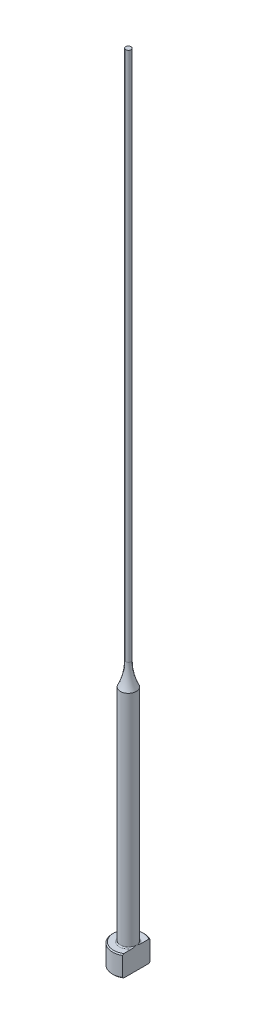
from build123d import *
from build123d.topology import SkipClean

# Parameters (mm, degrees)
CHAMFER1_SIZE    = 0.2
FILLET1_R        = 0.2
KEYED_HEAD_DEPTH = 151.059988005


with BuildPart() as part:
    # Sketch1 → Revolve1 (revolve)
    with BuildSketch(Plane.XY, mode=Mode.PRIVATE) as revolve1_sk:
        with BuildLine():
            Line((0, 0), (-3, 0))
            Line((-3, 0), (-3, 4))
            Line((-3, 4), (-1.5, 4))
            Line((-1.5, 4), (-1.5, 45.641101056))
            ThreePointArc((-1.5, 45.641101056), (-0.753205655, 47.763932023), (-0.5, 50))
            Line((-0.5, 50), (-0.5, 150))
            Line((-0.5, 150), (0, 150))
            Line((0, 150), (0, 0))
        make_face()
    revolve(revolve1_sk.sketch.rotate(Axis((0, 259.958771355, 0), (0, -1, 0)), 270), axis=Axis((0, 259.958771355, 0), (0, -1, 0)))

    # Chamfer1
    chamfer1_edges = [part.edges().sort_by_distance(p)[0] for p in [
        (0, 0, -3),
        (0, 4, -3),
    ]]
    chamfer(chamfer1_edges, length=CHAMFER1_SIZE)

    # Fillet1
    fillet1_edges = [part.edges().sort_by_distance(p)[0] for p in [
        (0, 4, -1.5),
    ]]
    fillet(fillet1_edges, radius=FILLET1_R)

    # Sketch2 → Keyed Head (cut, through all)
    with SkipClean():  # the faces are left unmerged after this step: merging them gives an invalid solid
        with BuildSketch(Plane(origin=(0, 0, 0), x_dir=(1, 0, 0), z_dir=(0, 1, 0))):
            with BuildLine():
                Line((1.5, -2.598076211), (1.5, 2.598076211))
                ThreePointArc((1.5, 2.598076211), (3, 0), (1.5, -2.598076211))
            make_face()
        extrude(amount=KEYED_HEAD_DEPTH, mode=Mode.SUBTRACT)


solid = part.part
